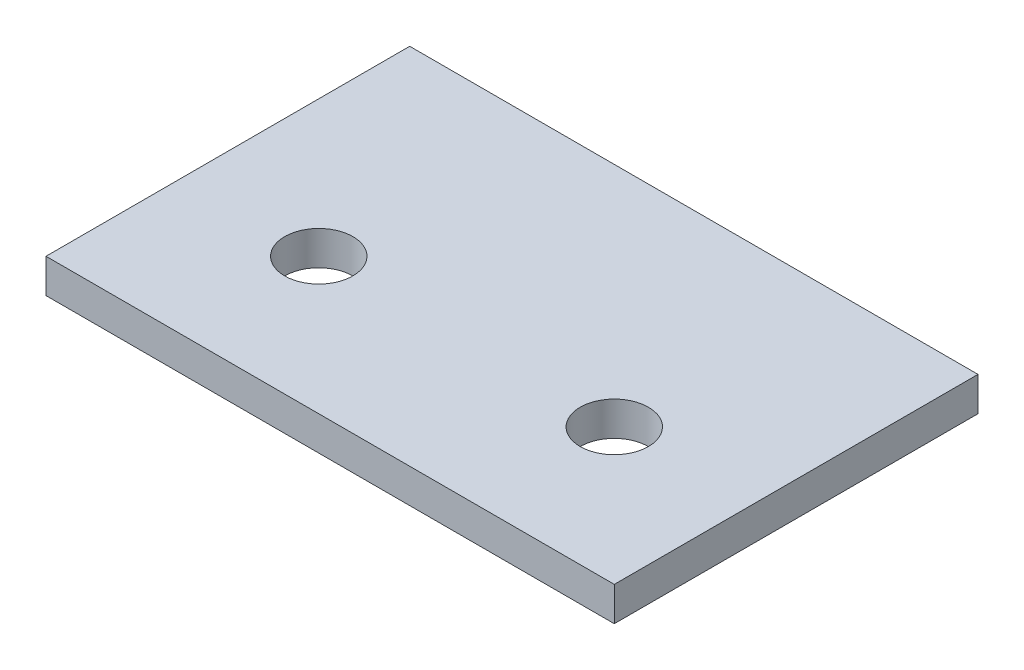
from build123d import *

# Parameters (mm, degrees)
SKETCH_1_W      = 25
SKETCH_1_H      = 16
SKETCH_1_R      = 1.5
EXTRUDE_1_DEPTH = 1.5


with BuildPart() as part:
    # Sketch 1 → Extrude 1 (new body)
    with BuildSketch(Plane(origin=(0, 0, 0), x_dir=(1, 0, 0), z_dir=(0, 1, 0))):
        with Locations((12.5, 8)):
            Rectangle(SKETCH_1_W, SKETCH_1_H)
        with Locations(Location((6, 6, 0), (0, 0, 270))):
            Circle(SKETCH_1_R, mode=Mode.SUBTRACT)
        with Locations(Location((19, 6, 0), (0, 0, 270))):
            Circle(SKETCH_1_R, mode=Mode.SUBTRACT)
    extrude(amount=EXTRUDE_1_DEPTH)


solid = part.part
